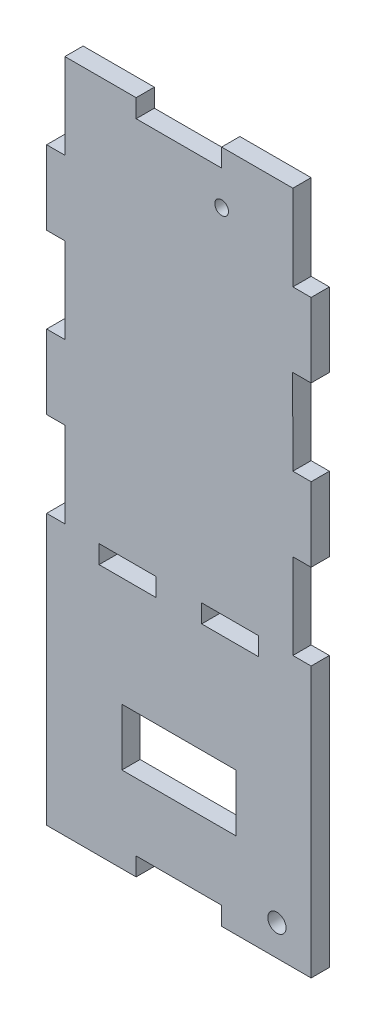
ISO-10303-21;
HEADER;
FILE_DESCRIPTION(('STEP AP214'),'2;1');
FILE_NAME('part.step','',(''),(''),'','','');
FILE_SCHEMA(('AUTOMOTIVE_DESIGN { 1 0 10303 214 1 1 1 1 }'));
ENDSEC;
DATA;
#1=APPLICATION_CONTEXT('core data for automotive mechanical design processes');
#2=APPLICATION_PROTOCOL_DEFINITION('international standard','automotive_design',2000,#1);
#3=PRODUCT_CONTEXT('',#1,'mechanical');
#4=PRODUCT('Part','Part','',(#3));
#5=PRODUCT_RELATED_PRODUCT_CATEGORY('part','',(#4));
#6=PRODUCT_DEFINITION_FORMATION('','',#4);
#7=PRODUCT_DEFINITION_CONTEXT('part definition',#1,'design');
#8=PRODUCT_DEFINITION('design','',#6,#7);
#9=PRODUCT_DEFINITION_SHAPE('','',#8);
#10=(LENGTH_UNIT() NAMED_UNIT(*) SI_UNIT(.MILLI.,.METRE.));
#11=(NAMED_UNIT(*) PLANE_ANGLE_UNIT() SI_UNIT($,.RADIAN.));
#12=(NAMED_UNIT(*) SI_UNIT($,.STERADIAN.) SOLID_ANGLE_UNIT());
#13=UNCERTAINTY_MEASURE_WITH_UNIT(LENGTH_MEASURE(1.E-05),#10,'distance_accuracy_value','');
#14=(GEOMETRIC_REPRESENTATION_CONTEXT(3) GLOBAL_UNCERTAINTY_ASSIGNED_CONTEXT((#13)) GLOBAL_UNIT_ASSIGNED_CONTEXT((#10,
#11,#12)) REPRESENTATION_CONTEXT('',''));
#15=CARTESIAN_POINT('',(0.,0.,0.));
#16=DIRECTION('',(0.,0.,1.));
#17=DIRECTION('',(1.,0.,0.));
#18=AXIS2_PLACEMENT_3D('',#15,#16,#17);
#19=CARTESIAN_POINT('',(0.,0.,16.));
#20=DIRECTION('',(0.,0.,-1.));
#21=DIRECTION('',(-1.,0.,0.));
#22=AXIS2_PLACEMENT_3D('',#19,#20,#21);
#23=PLANE('',#22);
#24=DIRECTION('',(0.,-1.,0.));
#25=VECTOR('',#24,1.);
#26=CARTESIAN_POINT('',(53.9999999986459,68.,16.));
#27=LINE('',#26,#25);
#28=CARTESIAN_POINT('',(53.9999999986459,68.,16.));
#29=VERTEX_POINT('',#28);
#30=CARTESIAN_POINT('',(53.9999999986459,18.,16.));
#31=VERTEX_POINT('',#30);
#32=EDGE_CURVE('E934',#29,#31,#27,.T.);
#33=ORIENTED_EDGE('',*,*,#32,.F.);
#34=DIRECTION('',(1.,0.,0.));
#35=VECTOR('',#34,1.);
#36=CARTESIAN_POINT('',(53.9999999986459,68.,16.));
#37=LINE('',#36,#35);
#38=CARTESIAN_POINT('',(153.999999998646,68.,16.));
#39=VERTEX_POINT('',#38);
#40=EDGE_CURVE('E931',#29,#39,#37,.T.);
#41=ORIENTED_EDGE('',*,*,#40,.T.);
#42=DIRECTION('',(0.,-1.,0.));
#43=VECTOR('',#42,1.);
#44=CARTESIAN_POINT('',(153.999999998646,68.,16.));
#45=LINE('',#44,#43);
#46=CARTESIAN_POINT('',(153.999999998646,18.,16.));
#47=VERTEX_POINT('',#46);
#48=EDGE_CURVE('E937',#39,#47,#45,.T.);
#49=ORIENTED_EDGE('',*,*,#48,.T.);
#50=DIRECTION('',(1.,0.,0.));
#51=VECTOR('',#50,1.);
#52=CARTESIAN_POINT('',(53.9999999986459,18.,16.));
#53=LINE('',#52,#51);
#54=EDGE_CURVE('E941',#31,#47,#53,.T.);
#55=ORIENTED_EDGE('',*,*,#54,.F.);
#56=EDGE_LOOP('',(#33,#41,#49,#55));
#57=FACE_BOUND('',#56,.T.);
#58=DIRECTION('',(0.,1.,0.));
#59=VECTOR('',#58,1.);
#60=CARTESIAN_POINT('',(-12.0000000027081,163.999999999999,16.));
#61=LINE('',#60,#59);
#62=CARTESIAN_POINT('',(-12.0000000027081,-57.,16.));
#63=VERTEX_POINT('',#62);
#64=CARTESIAN_POINT('',(-12.0000000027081,179.999999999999,16.));
#65=VERTEX_POINT('',#64);
#66=EDGE_CURVE('E1038',#63,#65,#61,.T.);
#67=ORIENTED_EDGE('',*,*,#66,.F.);
#68=DIRECTION('',(-1.,0.,0.));
#69=VECTOR('',#68,1.);
#70=CARTESIAN_POINT('',(66.499999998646,-56.9999999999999,16.));
#71=LINE('',#70,#69);
#72=CARTESIAN_POINT('',(66.499999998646,-56.9999999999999,16.));
#73=VERTEX_POINT('',#72);
#74=EDGE_CURVE('E1116',#73,#63,#71,.T.);
#75=ORIENTED_EDGE('',*,*,#74,.F.);
#76=DIRECTION('',(0.,1.,0.));
#77=VECTOR('',#76,1.);
#78=CARTESIAN_POINT('',(66.499999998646,-56.9999999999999,16.));
#79=LINE('',#78,#77);
#80=CARTESIAN_POINT('',(66.499999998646,-40.9999999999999,16.));
#81=VERTEX_POINT('',#80);
#82=EDGE_CURVE('E1114',#73,#81,#79,.T.);
#83=ORIENTED_EDGE('',*,*,#82,.T.);
#84=DIRECTION('',(1.,0.,0.));
#85=VECTOR('',#84,1.);
#86=CARTESIAN_POINT('',(66.499999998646,-40.9999999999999,16.));
#87=LINE('',#86,#85);
#88=CARTESIAN_POINT('',(141.499999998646,-40.9999999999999,16.));
#89=VERTEX_POINT('',#88);
#90=EDGE_CURVE('E1112',#81,#89,#87,.T.);
#91=ORIENTED_EDGE('',*,*,#90,.T.);
#92=DIRECTION('',(0.,1.,0.));
#93=VECTOR('',#92,1.);
#94=CARTESIAN_POINT('',(141.499999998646,-56.9999999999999,16.));
#95=LINE('',#94,#93);
#96=CARTESIAN_POINT('',(141.499999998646,-56.9999999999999,16.));
#97=VERTEX_POINT('',#96);
#98=EDGE_CURVE('E1109',#97,#89,#95,.T.);
#99=ORIENTED_EDGE('',*,*,#98,.F.);
#100=DIRECTION('',(-1.,0.,0.));
#101=VECTOR('',#100,1.);
#102=CARTESIAN_POINT('',(220.,-56.9999999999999,16.));
#103=LINE('',#102,#101);
#104=CARTESIAN_POINT('',(220.,-56.9999999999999,16.));
#105=VERTEX_POINT('',#104);
#106=EDGE_CURVE('E1106',#105,#97,#103,.T.);
#107=ORIENTED_EDGE('',*,*,#106,.F.);
#108=DIRECTION('',(0.,1.,0.));
#109=VECTOR('',#108,1.);
#110=CARTESIAN_POINT('',(220.,163.999999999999,16.));
#111=LINE('',#110,#109);
#112=CARTESIAN_POINT('',(220.,180.,16.));
#113=VERTEX_POINT('',#112);
#114=EDGE_CURVE('E1104',#105,#113,#111,.T.);
#115=ORIENTED_EDGE('',*,*,#114,.T.);
#116=DIRECTION('',(-1.,0.,0.));
#117=VECTOR('',#116,1.);
#118=CARTESIAN_POINT('',(220.,180.,16.));
#119=LINE('',#118,#117);
#120=CARTESIAN_POINT('',(204.,179.999999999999,16.));
#121=VERTEX_POINT('',#120);
#122=EDGE_CURVE('E1102',#113,#121,#119,.T.);
#123=ORIENTED_EDGE('',*,*,#122,.T.);
#124=DIRECTION('',(-3.61081535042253E-11,-1.,0.));
#125=VECTOR('',#124,1.);
#126=CARTESIAN_POINT('',(204.000000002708,255.,16.));
#127=LINE('',#126,#125);
#128=CARTESIAN_POINT('',(204.000000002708,255.,16.));
#129=VERTEX_POINT('',#128);
#130=EDGE_CURVE('E1099',#129,#121,#127,.T.);
#131=ORIENTED_EDGE('',*,*,#130,.F.);
#132=DIRECTION('',(-0.999999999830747,-1.83985496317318E-05,0.));
#133=VECTOR('',#132,1.);
#134=CARTESIAN_POINT('',(220.,255.000294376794,16.));
#135=LINE('',#134,#133);
#136=CARTESIAN_POINT('',(220.,255.000294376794,16.));
#137=VERTEX_POINT('',#136);
#138=EDGE_CURVE('E1096',#137,#129,#135,.T.);
#139=ORIENTED_EDGE('',*,*,#138,.F.);
#140=DIRECTION('',(0.,1.,0.));
#141=VECTOR('',#140,1.);
#142=CARTESIAN_POINT('',(220.,255.000294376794,16.));
#143=LINE('',#142,#141);
#144=CARTESIAN_POINT('',(220.,320.000294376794,16.));
#145=VERTEX_POINT('',#144);
#146=EDGE_CURVE('E1094',#137,#145,#143,.T.);
#147=ORIENTED_EDGE('',*,*,#146,.T.);
#148=DIRECTION('',(-1.,0.,0.));
#149=VECTOR('',#148,1.);
#150=CARTESIAN_POINT('',(220.,320.000294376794,16.));
#151=LINE('',#150,#149);
#152=CARTESIAN_POINT('',(204.,320.000294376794,16.));
#153=VERTEX_POINT('',#152);
#154=EDGE_CURVE('E1092',#145,#153,#151,.T.);
#155=ORIENTED_EDGE('',*,*,#154,.T.);
#156=DIRECTION('',(0.00280179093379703,-0.999996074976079,0.));
#157=VECTOR('',#156,1.);
#158=CARTESIAN_POINT('',(203.789865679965,395.,16.));
#159=LINE('',#158,#157);
#160=CARTESIAN_POINT('',(203.789865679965,395.,16.));
#161=VERTEX_POINT('',#160);
#162=EDGE_CURVE('E1089',#161,#153,#159,.T.);
#163=ORIENTED_EDGE('',*,*,#162,.F.);
#164=DIRECTION('',(-1.,0.,0.));
#165=VECTOR('',#164,1.);
#166=CARTESIAN_POINT('',(220.,395.,16.));
#167=LINE('',#166,#165);
#168=CARTESIAN_POINT('',(220.,395.,16.));
#169=VERTEX_POINT('',#168);
#170=EDGE_CURVE('E1086',#169,#161,#167,.T.);
#171=ORIENTED_EDGE('',*,*,#170,.F.);
#172=DIRECTION('',(0.,1.,0.));
#173=VECTOR('',#172,1.);
#174=CARTESIAN_POINT('',(220.,395.,16.));
#175=LINE('',#174,#173);
#176=CARTESIAN_POINT('',(220.,460.,16.));
#177=VERTEX_POINT('',#176);
#178=EDGE_CURVE('E1084',#169,#177,#175,.T.);
#179=ORIENTED_EDGE('',*,*,#178,.T.);
#180=DIRECTION('',(-1.,0.,0.));
#181=VECTOR('',#180,1.);
#182=CARTESIAN_POINT('',(220.,460.,16.));
#183=LINE('',#182,#181);
#184=CARTESIAN_POINT('',(204.,460.,16.));
#185=VERTEX_POINT('',#184);
#186=EDGE_CURVE('E1082',#177,#185,#183,.T.);
#187=ORIENTED_EDGE('',*,*,#186,.T.);
#188=DIRECTION('',(0.,-1.,0.));
#189=VECTOR('',#188,1.);
#190=CARTESIAN_POINT('',(204.,535.,16.));
#191=LINE('',#190,#189);
#192=CARTESIAN_POINT('',(204.,535.,16.));
#193=VERTEX_POINT('',#192);
#194=EDGE_CURVE('E1079',#193,#185,#191,.T.);
#195=ORIENTED_EDGE('',*,*,#194,.F.);
#196=DIRECTION('',(-1.,0.,0.));
#197=VECTOR('',#196,1.);
#198=CARTESIAN_POINT('',(204.,535.,16.));
#199=LINE('',#198,#197);
#200=CARTESIAN_POINT('',(141.5,535.,16.));
#201=VERTEX_POINT('',#200);
#202=EDGE_CURVE('E1077',#193,#201,#199,.T.);
#203=ORIENTED_EDGE('',*,*,#202,.T.);
#204=DIRECTION('',(0.,-1.,0.));
#205=VECTOR('',#204,1.);
#206=CARTESIAN_POINT('',(141.5,535.,16.));
#207=LINE('',#206,#205);
#208=CARTESIAN_POINT('',(141.5,519.,16.));
#209=VERTEX_POINT('',#208);
#210=EDGE_CURVE('E1075',#201,#209,#207,.T.);
#211=ORIENTED_EDGE('',*,*,#210,.T.);
#212=DIRECTION('',(1.,0.,0.));
#213=VECTOR('',#212,1.);
#214=CARTESIAN_POINT('',(66.4999999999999,519.,16.));
#215=LINE('',#214,#213);
#216=CARTESIAN_POINT('',(66.4999999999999,519.,16.));
#217=VERTEX_POINT('',#216);
#218=EDGE_CURVE('E1072',#217,#209,#215,.T.);
#219=ORIENTED_EDGE('',*,*,#218,.F.);
#220=DIRECTION('',(0.,-1.,0.));
#221=VECTOR('',#220,1.);
#222=CARTESIAN_POINT('',(66.4999999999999,535.,16.));
#223=LINE('',#222,#221);
#224=CARTESIAN_POINT('',(66.4999999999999,535.,16.));
#225=VERTEX_POINT('',#224);
#226=EDGE_CURVE('E1069',#225,#217,#223,.T.);
#227=ORIENTED_EDGE('',*,*,#226,.F.);
#228=DIRECTION('',(-1.,0.,0.));
#229=VECTOR('',#228,1.);
#230=CARTESIAN_POINT('',(66.4999999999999,535.,16.));
#231=LINE('',#230,#229);
#232=CARTESIAN_POINT('',(3.99999999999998,535.,16.));
#233=VERTEX_POINT('',#232);
#234=EDGE_CURVE('E1067',#225,#233,#231,.T.);
#235=ORIENTED_EDGE('',*,*,#234,.T.);
#236=DIRECTION('',(0.,-1.,0.));
#237=VECTOR('',#236,1.);
#238=CARTESIAN_POINT('',(3.99999999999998,535.,16.));
#239=LINE('',#238,#237);
#240=CARTESIAN_POINT('',(3.99999999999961,460.,16.));
#241=VERTEX_POINT('',#240);
#242=EDGE_CURVE('E1065',#233,#241,#239,.T.);
#243=ORIENTED_EDGE('',*,*,#242,.T.);
#244=DIRECTION('',(1.,0.,0.));
#245=VECTOR('',#244,1.);
#246=CARTESIAN_POINT('',(-12.,460.,16.));
#247=LINE('',#246,#245);
#248=CARTESIAN_POINT('',(-12.,460.,16.));
#249=VERTEX_POINT('',#248);
#250=EDGE_CURVE('E1062',#249,#241,#247,.T.);
#251=ORIENTED_EDGE('',*,*,#250,.F.);
#252=DIRECTION('',(0.,1.,0.));
#253=VECTOR('',#252,1.);
#254=CARTESIAN_POINT('',(-12.,395.,16.));
#255=LINE('',#254,#253);
#256=CARTESIAN_POINT('',(-12.,395.,16.));
#257=VERTEX_POINT('',#256);
#258=EDGE_CURVE('E1059',#257,#249,#255,.T.);
#259=ORIENTED_EDGE('',*,*,#258,.F.);
#260=DIRECTION('',(1.,0.,0.));
#261=VECTOR('',#260,1.);
#262=CARTESIAN_POINT('',(-12.,395.,16.));
#263=LINE('',#262,#261);
#264=CARTESIAN_POINT('',(4.21013432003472,395.,16.));
#265=VERTEX_POINT('',#264);
#266=EDGE_CURVE('E1057',#257,#265,#263,.T.);
#267=ORIENTED_EDGE('',*,*,#266,.T.);
#268=DIRECTION('',(-0.00280179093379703,-0.999996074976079,0.));
#269=VECTOR('',#268,1.);
#270=CARTESIAN_POINT('',(4.21013432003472,395.,16.));
#271=LINE('',#270,#269);
#272=CARTESIAN_POINT('',(3.99999999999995,320.000294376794,16.));
#273=VERTEX_POINT('',#272);
#274=EDGE_CURVE('E1055',#265,#273,#271,.T.);
#275=ORIENTED_EDGE('',*,*,#274,.T.);
#276=DIRECTION('',(1.,0.,0.));
#277=VECTOR('',#276,1.);
#278=CARTESIAN_POINT('',(-12.,320.000294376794,16.));
#279=LINE('',#278,#277);
#280=CARTESIAN_POINT('',(-12.,320.000294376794,16.));
#281=VERTEX_POINT('',#280);
#282=EDGE_CURVE('E1052',#281,#273,#279,.T.);
#283=ORIENTED_EDGE('',*,*,#282,.F.);
#284=DIRECTION('',(0.,1.,0.));
#285=VECTOR('',#284,1.);
#286=CARTESIAN_POINT('',(-12.0000000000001,255.000294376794,16.));
#287=LINE('',#286,#285);
#288=CARTESIAN_POINT('',(-12.0000000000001,255.000294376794,16.));
#289=VERTEX_POINT('',#288);
#290=EDGE_CURVE('E1049',#289,#281,#287,.T.);
#291=ORIENTED_EDGE('',*,*,#290,.F.);
#292=DIRECTION('',(0.999999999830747,-1.83985496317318E-05,0.));
#293=VECTOR('',#292,1.);
#294=CARTESIAN_POINT('',(-12.0000000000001,255.000294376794,16.));
#295=LINE('',#294,#293);
#296=CARTESIAN_POINT('',(3.99999999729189,255.,16.));
#297=VERTEX_POINT('',#296);
#298=EDGE_CURVE('E1047',#289,#297,#295,.T.);
#299=ORIENTED_EDGE('',*,*,#298,.T.);
#300=DIRECTION('',(0.,-1.,0.));
#301=VECTOR('',#300,1.);
#302=CARTESIAN_POINT('',(3.99999999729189,255.,16.));
#303=LINE('',#302,#301);
#304=CARTESIAN_POINT('',(3.99999999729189,179.999999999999,16.));
#305=VERTEX_POINT('',#304);
#306=EDGE_CURVE('E1045',#297,#305,#303,.T.);
#307=ORIENTED_EDGE('',*,*,#306,.T.);
#308=DIRECTION('',(1.,0.,0.));
#309=VECTOR('',#308,1.);
#310=CARTESIAN_POINT('',(-12.0000000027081,179.999999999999,16.));
#311=LINE('',#310,#309);
#312=EDGE_CURVE('E1041',#65,#305,#311,.T.);
#313=ORIENTED_EDGE('',*,*,#312,.F.);
#314=EDGE_LOOP('',(#67,#75,#83,#91,#99,#107,#115,#123,#131,#139,#147,#155,#163,#171,#179,#187,
#195,#203,#211,#219,#227,#235,#243,#251,#259,#267,#275,#283,#291,#299,#307,#313));
#315=FACE_BOUND('',#314,.T.);
#316=DIRECTION('',(1.,0.,0.));
#317=VECTOR('',#316,1.);
#318=CARTESIAN_POINT('',(0.,179.999999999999,16.));
#319=LINE('',#318,#317);
#320=CARTESIAN_POINT('',(33.9999999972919,179.999999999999,16.));
#321=VERTEX_POINT('',#320);
#322=CARTESIAN_POINT('',(83.9999999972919,179.999999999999,16.));
#323=VERTEX_POINT('',#322);
#324=EDGE_CURVE('E1010',#321,#323,#319,.T.);
#325=ORIENTED_EDGE('',*,*,#324,.T.);
#326=DIRECTION('',(0.,-1.,0.));
#327=VECTOR('',#326,1.);
#328=CARTESIAN_POINT('',(83.9999999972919,0.,16.));
#329=LINE('',#328,#327);
#330=CARTESIAN_POINT('',(83.9999999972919,163.999999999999,16.));
#331=VERTEX_POINT('',#330);
#332=EDGE_CURVE('E1007',#323,#331,#329,.T.);
#333=ORIENTED_EDGE('',*,*,#332,.T.);
#334=DIRECTION('',(1.,0.,0.));
#335=VECTOR('',#334,1.);
#336=CARTESIAN_POINT('',(0.,163.999999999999,16.));
#337=LINE('',#336,#335);
#338=CARTESIAN_POINT('',(33.9999999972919,163.999999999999,16.));
#339=VERTEX_POINT('',#338);
#340=EDGE_CURVE('E1017',#339,#331,#337,.T.);
#341=ORIENTED_EDGE('',*,*,#340,.F.);
#342=DIRECTION('',(0.,-1.,0.));
#343=VECTOR('',#342,1.);
#344=CARTESIAN_POINT('',(33.9999999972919,0.,16.));
#345=LINE('',#344,#343);
#346=EDGE_CURVE('E1014',#321,#339,#345,.T.);
#347=ORIENTED_EDGE('',*,*,#346,.F.);
#348=EDGE_LOOP('',(#325,#333,#341,#347));
#349=FACE_BOUND('',#348,.T.);
#350=DIRECTION('',(-1.,0.,0.));
#351=VECTOR('',#350,1.);
#352=CARTESIAN_POINT('',(0.,179.999999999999,16.));
#353=LINE('',#352,#351);
#354=CARTESIAN_POINT('',(174.,179.999999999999,16.));
#355=VERTEX_POINT('',#354);
#356=CARTESIAN_POINT('',(124.,179.999999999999,16.));
#357=VERTEX_POINT('',#356);
#358=EDGE_CURVE('E975',#355,#357,#353,.T.);
#359=ORIENTED_EDGE('',*,*,#358,.F.);
#360=DIRECTION('',(0.,-1.,0.));
#361=VECTOR('',#360,1.);
#362=CARTESIAN_POINT('',(174.,0.,16.));
#363=LINE('',#362,#361);
#364=CARTESIAN_POINT('',(174.,163.999999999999,16.));
#365=VERTEX_POINT('',#364);
#366=EDGE_CURVE('E983',#355,#365,#363,.T.);
#367=ORIENTED_EDGE('',*,*,#366,.T.);
#368=DIRECTION('',(-1.,0.,0.));
#369=VECTOR('',#368,1.);
#370=CARTESIAN_POINT('',(0.,163.999999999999,16.));
#371=LINE('',#370,#369);
#372=CARTESIAN_POINT('',(124.,163.999999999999,16.));
#373=VERTEX_POINT('',#372);
#374=EDGE_CURVE('E980',#365,#373,#371,.T.);
#375=ORIENTED_EDGE('',*,*,#374,.T.);
#376=DIRECTION('',(0.,-1.,0.));
#377=VECTOR('',#376,1.);
#378=CARTESIAN_POINT('',(124.,0.,16.));
#379=LINE('',#378,#377);
#380=EDGE_CURVE('E977',#357,#373,#379,.T.);
#381=ORIENTED_EDGE('',*,*,#380,.F.);
#382=EDGE_LOOP('',(#359,#367,#375,#381));
#383=FACE_BOUND('',#382,.T.);
#384=CARTESIAN_POINT('',(141.5,489.,16.));
#385=DIRECTION('',(0.,0.,1.));
#386=DIRECTION('',(1.,0.,0.));
#387=AXIS2_PLACEMENT_3D('',#384,#385,#386);
#388=CIRCLE('',#387,6.00000000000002);
#389=CARTESIAN_POINT('',(147.5,489.,16.));
#390=VERTEX_POINT('',#389);
#391=EDGE_CURVE('E969',#390,#390,#388,.T.);
#392=ORIENTED_EDGE('',*,*,#391,.F.);
#393=EDGE_LOOP('',(#392));
#394=FACE_BOUND('',#393,.T.);
#395=CARTESIAN_POINT('',(190.,-30.,16.));
#396=DIRECTION('',(0.,0.,1.));
#397=DIRECTION('',(1.,0.,0.));
#398=AXIS2_PLACEMENT_3D('',#395,#396,#397);
#399=CIRCLE('',#398,8.00000000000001);
#400=CARTESIAN_POINT('',(198.,-30.,16.));
#401=VERTEX_POINT('',#400);
#402=EDGE_CURVE('E963',#401,#401,#399,.T.);
#403=ORIENTED_EDGE('',*,*,#402,.F.);
#404=EDGE_LOOP('',(#403));
#405=FACE_BOUND('',#404,.T.);
#406=ADVANCED_FACE('F646',(#57,#315,#349,#383,#394,#405),#23,.F.);
#407=CARTESIAN_POINT('',(0.,0.,0.));
#408=DIRECTION('',(0.,0.,-1.));
#409=DIRECTION('',(-1.,0.,0.));
#410=AXIS2_PLACEMENT_3D('',#407,#408,#409);
#411=PLANE('',#410);
#412=DIRECTION('',(1.,0.,0.));
#413=VECTOR('',#412,1.);
#414=CARTESIAN_POINT('',(53.9999999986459,68.,0.));
#415=LINE('',#414,#413);
#416=CARTESIAN_POINT('',(53.9999999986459,68.,0.));
#417=VERTEX_POINT('',#416);
#418=CARTESIAN_POINT('',(153.999999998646,68.,0.));
#419=VERTEX_POINT('',#418);
#420=EDGE_CURVE('E671',#417,#419,#415,.T.);
#421=ORIENTED_EDGE('',*,*,#420,.F.);
#422=DIRECTION('',(0.,-1.,0.));
#423=VECTOR('',#422,1.);
#424=CARTESIAN_POINT('',(53.9999999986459,68.,0.));
#425=LINE('',#424,#423);
#426=CARTESIAN_POINT('',(53.9999999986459,18.,0.));
#427=VERTEX_POINT('',#426);
#428=EDGE_CURVE('E944',#417,#427,#425,.T.);
#429=ORIENTED_EDGE('',*,*,#428,.T.);
#430=DIRECTION('',(1.,0.,0.));
#431=VECTOR('',#430,1.);
#432=CARTESIAN_POINT('',(53.9999999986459,18.,0.));
#433=LINE('',#432,#431);
#434=CARTESIAN_POINT('',(153.999999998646,18.,0.));
#435=VERTEX_POINT('',#434);
#436=EDGE_CURVE('E947',#427,#435,#433,.T.);
#437=ORIENTED_EDGE('',*,*,#436,.T.);
#438=DIRECTION('',(0.,-1.,0.));
#439=VECTOR('',#438,1.);
#440=CARTESIAN_POINT('',(153.999999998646,68.,0.));
#441=LINE('',#440,#439);
#442=EDGE_CURVE('E953',#419,#435,#441,.T.);
#443=ORIENTED_EDGE('',*,*,#442,.F.);
#444=EDGE_LOOP('',(#421,#429,#437,#443));
#445=FACE_BOUND('',#444,.T.);
#446=CARTESIAN_POINT('',(141.5,489.,0.));
#447=DIRECTION('',(0.,0.,1.));
#448=DIRECTION('',(1.,0.,0.));
#449=AXIS2_PLACEMENT_3D('',#446,#447,#448);
#450=CIRCLE('',#449,6.00000000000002);
#451=CARTESIAN_POINT('',(147.5,489.,0.));
#452=VERTEX_POINT('',#451);
#453=EDGE_CURVE('E966',#452,#452,#450,.T.);
#454=ORIENTED_EDGE('',*,*,#453,.T.);
#455=EDGE_LOOP('',(#454));
#456=FACE_BOUND('',#455,.T.);
#457=DIRECTION('',(0.,-1.,0.));
#458=VECTOR('',#457,1.);
#459=CARTESIAN_POINT('',(83.9999999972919,0.,0.));
#460=LINE('',#459,#458);
#461=CARTESIAN_POINT('',(83.9999999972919,179.999999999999,0.));
#462=VERTEX_POINT('',#461);
#463=CARTESIAN_POINT('',(83.9999999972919,163.999999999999,0.));
#464=VERTEX_POINT('',#463);
#465=EDGE_CURVE('E1006',#462,#464,#460,.T.);
#466=ORIENTED_EDGE('',*,*,#465,.F.);
#467=DIRECTION('',(1.,0.,0.));
#468=VECTOR('',#467,1.);
#469=CARTESIAN_POINT('',(0.,179.999999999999,0.));
#470=LINE('',#469,#468);
#471=CARTESIAN_POINT('',(33.9999999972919,179.999999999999,0.));
#472=VERTEX_POINT('',#471);
#473=EDGE_CURVE('E1021',#472,#462,#470,.T.);
#474=ORIENTED_EDGE('',*,*,#473,.F.);
#475=DIRECTION('',(0.,-1.,0.));
#476=VECTOR('',#475,1.);
#477=CARTESIAN_POINT('',(33.9999999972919,0.,0.));
#478=LINE('',#477,#476);
#479=CARTESIAN_POINT('',(33.9999999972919,163.999999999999,0.));
#480=VERTEX_POINT('',#479);
#481=EDGE_CURVE('E1024',#472,#480,#478,.T.);
#482=ORIENTED_EDGE('',*,*,#481,.T.);
#483=DIRECTION('',(1.,0.,0.));
#484=VECTOR('',#483,1.);
#485=CARTESIAN_POINT('',(0.,163.999999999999,0.));
#486=LINE('',#485,#484);
#487=EDGE_CURVE('E1011',#480,#464,#486,.T.);
#488=ORIENTED_EDGE('',*,*,#487,.T.);
#489=EDGE_LOOP('',(#466,#474,#482,#488));
#490=FACE_BOUND('',#489,.T.);
#491=DIRECTION('',(0.,-1.,0.));
#492=VECTOR('',#491,1.);
#493=CARTESIAN_POINT('',(-12.0000000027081,163.999999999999,0.));
#494=LINE('',#493,#492);
#495=CARTESIAN_POINT('',(-12.0000000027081,179.999999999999,0.));
#496=VERTEX_POINT('',#495);
#497=CARTESIAN_POINT('',(-12.0000000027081,-57.,0.));
#498=VERTEX_POINT('',#497);
#499=EDGE_CURVE('E1042',#496,#498,#494,.T.);
#500=ORIENTED_EDGE('',*,*,#499,.F.);
#501=DIRECTION('',(1.,0.,0.));
#502=VECTOR('',#501,1.);
#503=CARTESIAN_POINT('',(-12.0000000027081,179.999999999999,0.));
#504=LINE('',#503,#502);
#505=CARTESIAN_POINT('',(3.99999999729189,179.999999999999,0.));
#506=VERTEX_POINT('',#505);
#507=EDGE_CURVE('E1037',#496,#506,#504,.T.);
#508=ORIENTED_EDGE('',*,*,#507,.T.);
#509=DIRECTION('',(0.,-1.,0.));
#510=VECTOR('',#509,1.);
#511=CARTESIAN_POINT('',(3.99999999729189,255.,0.));
#512=LINE('',#511,#510);
#513=CARTESIAN_POINT('',(3.99999999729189,255.,0.));
#514=VERTEX_POINT('',#513);
#515=EDGE_CURVE('E1121',#514,#506,#512,.T.);
#516=ORIENTED_EDGE('',*,*,#515,.F.);
#517=DIRECTION('',(0.999999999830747,-1.83985496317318E-05,0.));
#518=VECTOR('',#517,1.);
#519=CARTESIAN_POINT('',(-12.0000000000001,255.000294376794,0.));
#520=LINE('',#519,#518);
#521=CARTESIAN_POINT('',(-12.0000000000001,255.000294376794,0.));
#522=VERTEX_POINT('',#521);
#523=EDGE_CURVE('E1124',#522,#514,#520,.T.);
#524=ORIENTED_EDGE('',*,*,#523,.F.);
#525=DIRECTION('',(0.,1.,0.));
#526=VECTOR('',#525,1.);
#527=CARTESIAN_POINT('',(-12.0000000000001,255.000294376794,0.));
#528=LINE('',#527,#526);
#529=CARTESIAN_POINT('',(-12.,320.000294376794,0.));
#530=VERTEX_POINT('',#529);
#531=EDGE_CURVE('E1126',#522,#530,#528,.T.);
#532=ORIENTED_EDGE('',*,*,#531,.T.);
#533=DIRECTION('',(1.,0.,0.));
#534=VECTOR('',#533,1.);
#535=CARTESIAN_POINT('',(-12.,320.000294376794,0.));
#536=LINE('',#535,#534);
#537=CARTESIAN_POINT('',(3.99999999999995,320.000294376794,0.));
#538=VERTEX_POINT('',#537);
#539=EDGE_CURVE('E1129',#530,#538,#536,.T.);
#540=ORIENTED_EDGE('',*,*,#539,.T.);
#541=DIRECTION('',(-0.00280179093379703,-0.999996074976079,0.));
#542=VECTOR('',#541,1.);
#543=CARTESIAN_POINT('',(4.21013432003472,395.,0.));
#544=LINE('',#543,#542);
#545=CARTESIAN_POINT('',(4.21013432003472,395.,0.));
#546=VERTEX_POINT('',#545);
#547=EDGE_CURVE('E1132',#546,#538,#544,.T.);
#548=ORIENTED_EDGE('',*,*,#547,.F.);
#549=DIRECTION('',(1.,0.,0.));
#550=VECTOR('',#549,1.);
#551=CARTESIAN_POINT('',(-12.,395.,0.));
#552=LINE('',#551,#550);
#553=CARTESIAN_POINT('',(-12.,395.,0.));
#554=VERTEX_POINT('',#553);
#555=EDGE_CURVE('E1135',#554,#546,#552,.T.);
#556=ORIENTED_EDGE('',*,*,#555,.F.);
#557=DIRECTION('',(0.,1.,0.));
#558=VECTOR('',#557,1.);
#559=CARTESIAN_POINT('',(-12.,395.,0.));
#560=LINE('',#559,#558);
#561=CARTESIAN_POINT('',(-12.,460.,0.));
#562=VERTEX_POINT('',#561);
#563=EDGE_CURVE('E1137',#554,#562,#560,.T.);
#564=ORIENTED_EDGE('',*,*,#563,.T.);
#565=DIRECTION('',(1.,0.,0.));
#566=VECTOR('',#565,1.);
#567=CARTESIAN_POINT('',(-12.,460.,0.));
#568=LINE('',#567,#566);
#569=CARTESIAN_POINT('',(3.99999999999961,460.,0.));
#570=VERTEX_POINT('',#569);
#571=EDGE_CURVE('E1140',#562,#570,#568,.T.);
#572=ORIENTED_EDGE('',*,*,#571,.T.);
#573=DIRECTION('',(0.,-1.,0.));
#574=VECTOR('',#573,1.);
#575=CARTESIAN_POINT('',(3.99999999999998,535.,0.));
#576=LINE('',#575,#574);
#577=CARTESIAN_POINT('',(3.99999999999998,535.,0.));
#578=VERTEX_POINT('',#577);
#579=EDGE_CURVE('E1143',#578,#570,#576,.T.);
#580=ORIENTED_EDGE('',*,*,#579,.F.);
#581=DIRECTION('',(-1.,0.,0.));
#582=VECTOR('',#581,1.);
#583=CARTESIAN_POINT('',(66.4999999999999,535.,0.));
#584=LINE('',#583,#582);
#585=CARTESIAN_POINT('',(66.4999999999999,535.,0.));
#586=VERTEX_POINT('',#585);
#587=EDGE_CURVE('E1146',#586,#578,#584,.T.);
#588=ORIENTED_EDGE('',*,*,#587,.F.);
#589=DIRECTION('',(0.,-1.,0.));
#590=VECTOR('',#589,1.);
#591=CARTESIAN_POINT('',(66.4999999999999,535.,0.));
#592=LINE('',#591,#590);
#593=CARTESIAN_POINT('',(66.4999999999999,519.,0.));
#594=VERTEX_POINT('',#593);
#595=EDGE_CURVE('E1148',#586,#594,#592,.T.);
#596=ORIENTED_EDGE('',*,*,#595,.T.);
#597=DIRECTION('',(1.,0.,0.));
#598=VECTOR('',#597,1.);
#599=CARTESIAN_POINT('',(66.4999999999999,519.,0.));
#600=LINE('',#599,#598);
#601=CARTESIAN_POINT('',(141.5,519.,0.));
#602=VERTEX_POINT('',#601);
#603=EDGE_CURVE('E1151',#594,#602,#600,.T.);
#604=ORIENTED_EDGE('',*,*,#603,.T.);
#605=DIRECTION('',(0.,-1.,0.));
#606=VECTOR('',#605,1.);
#607=CARTESIAN_POINT('',(141.5,535.,0.));
#608=LINE('',#607,#606);
#609=CARTESIAN_POINT('',(141.5,535.,0.));
#610=VERTEX_POINT('',#609);
#611=EDGE_CURVE('E1154',#610,#602,#608,.T.);
#612=ORIENTED_EDGE('',*,*,#611,.F.);
#613=DIRECTION('',(-1.,0.,0.));
#614=VECTOR('',#613,1.);
#615=CARTESIAN_POINT('',(204.,535.,0.));
#616=LINE('',#615,#614);
#617=CARTESIAN_POINT('',(204.,535.,0.));
#618=VERTEX_POINT('',#617);
#619=EDGE_CURVE('E1157',#618,#610,#616,.T.);
#620=ORIENTED_EDGE('',*,*,#619,.F.);
#621=DIRECTION('',(0.,-1.,0.));
#622=VECTOR('',#621,1.);
#623=CARTESIAN_POINT('',(204.,535.,0.));
#624=LINE('',#623,#622);
#625=CARTESIAN_POINT('',(204.,460.,0.));
#626=VERTEX_POINT('',#625);
#627=EDGE_CURVE('E1159',#618,#626,#624,.T.);
#628=ORIENTED_EDGE('',*,*,#627,.T.);
#629=DIRECTION('',(-1.,0.,0.));
#630=VECTOR('',#629,1.);
#631=CARTESIAN_POINT('',(220.,460.,0.));
#632=LINE('',#631,#630);
#633=CARTESIAN_POINT('',(220.,460.,0.));
#634=VERTEX_POINT('',#633);
#635=EDGE_CURVE('E1162',#634,#626,#632,.T.);
#636=ORIENTED_EDGE('',*,*,#635,.F.);
#637=DIRECTION('',(0.,1.,0.));
#638=VECTOR('',#637,1.);
#639=CARTESIAN_POINT('',(220.,395.,0.));
#640=LINE('',#639,#638);
#641=CARTESIAN_POINT('',(220.,395.,0.));
#642=VERTEX_POINT('',#641);
#643=EDGE_CURVE('E1165',#642,#634,#640,.T.);
#644=ORIENTED_EDGE('',*,*,#643,.F.);
#645=DIRECTION('',(-1.,0.,0.));
#646=VECTOR('',#645,1.);
#647=CARTESIAN_POINT('',(220.,395.,0.));
#648=LINE('',#647,#646);
#649=CARTESIAN_POINT('',(203.789865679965,395.,0.));
#650=VERTEX_POINT('',#649);
#651=EDGE_CURVE('E1167',#642,#650,#648,.T.);
#652=ORIENTED_EDGE('',*,*,#651,.T.);
#653=DIRECTION('',(0.00280179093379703,-0.999996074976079,0.));
#654=VECTOR('',#653,1.);
#655=CARTESIAN_POINT('',(203.789865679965,395.,0.));
#656=LINE('',#655,#654);
#657=CARTESIAN_POINT('',(204.,320.000294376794,0.));
#658=VERTEX_POINT('',#657);
#659=EDGE_CURVE('E1170',#650,#658,#656,.T.);
#660=ORIENTED_EDGE('',*,*,#659,.T.);
#661=DIRECTION('',(-1.,0.,0.));
#662=VECTOR('',#661,1.);
#663=CARTESIAN_POINT('',(220.,320.000294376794,0.));
#664=LINE('',#663,#662);
#665=CARTESIAN_POINT('',(220.,320.000294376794,0.));
#666=VERTEX_POINT('',#665);
#667=EDGE_CURVE('E1173',#666,#658,#664,.T.);
#668=ORIENTED_EDGE('',*,*,#667,.F.);
#669=DIRECTION('',(0.,1.,0.));
#670=VECTOR('',#669,1.);
#671=CARTESIAN_POINT('',(220.,255.000294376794,0.));
#672=LINE('',#671,#670);
#673=CARTESIAN_POINT('',(220.,255.000294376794,0.));
#674=VERTEX_POINT('',#673);
#675=EDGE_CURVE('E1176',#674,#666,#672,.T.);
#676=ORIENTED_EDGE('',*,*,#675,.F.);
#677=DIRECTION('',(-0.999999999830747,-1.83985496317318E-05,0.));
#678=VECTOR('',#677,1.);
#679=CARTESIAN_POINT('',(220.,255.000294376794,0.));
#680=LINE('',#679,#678);
#681=CARTESIAN_POINT('',(204.000000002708,255.,0.));
#682=VERTEX_POINT('',#681);
#683=EDGE_CURVE('E1178',#674,#682,#680,.T.);
#684=ORIENTED_EDGE('',*,*,#683,.T.);
#685=DIRECTION('',(-3.61081535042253E-11,-1.,0.));
#686=VECTOR('',#685,1.);
#687=CARTESIAN_POINT('',(204.000000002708,255.,0.));
#688=LINE('',#687,#686);
#689=CARTESIAN_POINT('',(204.,179.999999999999,0.));
#690=VERTEX_POINT('',#689);
#691=EDGE_CURVE('E1181',#682,#690,#688,.T.);
#692=ORIENTED_EDGE('',*,*,#691,.T.);
#693=DIRECTION('',(-1.,0.,0.));
#694=VECTOR('',#693,1.);
#695=CARTESIAN_POINT('',(220.,180.,0.));
#696=LINE('',#695,#694);
#697=CARTESIAN_POINT('',(220.,180.,0.));
#698=VERTEX_POINT('',#697);
#699=EDGE_CURVE('E1184',#698,#690,#696,.T.);
#700=ORIENTED_EDGE('',*,*,#699,.F.);
#701=DIRECTION('',(0.,1.,0.));
#702=VECTOR('',#701,1.);
#703=CARTESIAN_POINT('',(220.,-56.9999999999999,0.));
#704=LINE('',#703,#702);
#705=CARTESIAN_POINT('',(220.,-56.9999999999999,0.));
#706=VERTEX_POINT('',#705);
#707=EDGE_CURVE('E1187',#706,#698,#704,.T.);
#708=ORIENTED_EDGE('',*,*,#707,.F.);
#709=DIRECTION('',(-1.,0.,0.));
#710=VECTOR('',#709,1.);
#711=CARTESIAN_POINT('',(220.,-56.9999999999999,0.));
#712=LINE('',#711,#710);
#713=CARTESIAN_POINT('',(141.499999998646,-56.9999999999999,0.));
#714=VERTEX_POINT('',#713);
#715=EDGE_CURVE('E1189',#706,#714,#712,.T.);
#716=ORIENTED_EDGE('',*,*,#715,.T.);
#717=DIRECTION('',(0.,1.,0.));
#718=VECTOR('',#717,1.);
#719=CARTESIAN_POINT('',(141.499999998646,-56.9999999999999,0.));
#720=LINE('',#719,#718);
#721=CARTESIAN_POINT('',(141.499999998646,-40.9999999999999,0.));
#722=VERTEX_POINT('',#721);
#723=EDGE_CURVE('E1192',#714,#722,#720,.T.);
#724=ORIENTED_EDGE('',*,*,#723,.T.);
#725=DIRECTION('',(1.,0.,0.));
#726=VECTOR('',#725,1.);
#727=CARTESIAN_POINT('',(66.499999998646,-40.9999999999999,0.));
#728=LINE('',#727,#726);
#729=CARTESIAN_POINT('',(66.499999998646,-40.9999999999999,0.));
#730=VERTEX_POINT('',#729);
#731=EDGE_CURVE('E1195',#730,#722,#728,.T.);
#732=ORIENTED_EDGE('',*,*,#731,.F.);
#733=DIRECTION('',(0.,1.,0.));
#734=VECTOR('',#733,1.);
#735=CARTESIAN_POINT('',(66.499999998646,-56.9999999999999,0.));
#736=LINE('',#735,#734);
#737=CARTESIAN_POINT('',(66.499999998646,-56.9999999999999,0.));
#738=VERTEX_POINT('',#737);
#739=EDGE_CURVE('E1198',#738,#730,#736,.T.);
#740=ORIENTED_EDGE('',*,*,#739,.F.);
#741=DIRECTION('',(-1.,0.,0.));
#742=VECTOR('',#741,1.);
#743=CARTESIAN_POINT('',(66.499999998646,-56.9999999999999,0.));
#744=LINE('',#743,#742);
#745=EDGE_CURVE('E1200',#738,#498,#744,.T.);
#746=ORIENTED_EDGE('',*,*,#745,.T.);
#747=EDGE_LOOP('',(#500,#508,#516,#524,#532,#540,#548,#556,#564,#572,#580,#588,#596,#604,#612,
#620,#628,#636,#644,#652,#660,#668,#676,#684,#692,#700,#708,#716,#724,#732,#740,#746));
#748=FACE_BOUND('',#747,.T.);
#749=DIRECTION('',(0.,-1.,0.));
#750=VECTOR('',#749,1.);
#751=CARTESIAN_POINT('',(174.,0.,0.));
#752=LINE('',#751,#750);
#753=CARTESIAN_POINT('',(174.,179.999999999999,0.));
#754=VERTEX_POINT('',#753);
#755=CARTESIAN_POINT('',(174.,163.999999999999,0.));
#756=VERTEX_POINT('',#755);
#757=EDGE_CURVE('E978',#754,#756,#752,.T.);
#758=ORIENTED_EDGE('',*,*,#757,.F.);
#759=DIRECTION('',(-1.,0.,0.));
#760=VECTOR('',#759,1.);
#761=CARTESIAN_POINT('',(0.,179.999999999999,0.));
#762=LINE('',#761,#760);
#763=CARTESIAN_POINT('',(124.,179.999999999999,0.));
#764=VERTEX_POINT('',#763);
#765=EDGE_CURVE('E972',#754,#764,#762,.T.);
#766=ORIENTED_EDGE('',*,*,#765,.T.);
#767=DIRECTION('',(0.,-1.,0.));
#768=VECTOR('',#767,1.);
#769=CARTESIAN_POINT('',(124.,0.,0.));
#770=LINE('',#769,#768);
#771=CARTESIAN_POINT('',(124.,163.999999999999,0.));
#772=VERTEX_POINT('',#771);
#773=EDGE_CURVE('E989',#764,#772,#770,.T.);
#774=ORIENTED_EDGE('',*,*,#773,.T.);
#775=DIRECTION('',(-1.,0.,0.));
#776=VECTOR('',#775,1.);
#777=CARTESIAN_POINT('',(0.,163.999999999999,0.));
#778=LINE('',#777,#776);
#779=EDGE_CURVE('E992',#756,#772,#778,.T.);
#780=ORIENTED_EDGE('',*,*,#779,.F.);
#781=EDGE_LOOP('',(#758,#766,#774,#780));
#782=FACE_BOUND('',#781,.T.);
#783=CARTESIAN_POINT('',(190.,-30.,0.));
#784=DIRECTION('',(0.,0.,1.));
#785=DIRECTION('',(1.,0.,0.));
#786=AXIS2_PLACEMENT_3D('',#783,#784,#785);
#787=CIRCLE('',#786,8.00000000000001);
#788=CARTESIAN_POINT('',(198.,-30.,0.));
#789=VERTEX_POINT('',#788);
#790=EDGE_CURVE('E959',#789,#789,#787,.T.);
#791=ORIENTED_EDGE('',*,*,#790,.T.);
#792=EDGE_LOOP('',(#791));
#793=FACE_BOUND('',#792,.T.);
#794=ADVANCED_FACE('F1279',(#445,#456,#490,#748,#782,#793),#411,.T.);
#795=CARTESIAN_POINT('',(-12.0000000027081,163.999999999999,16.));
#796=DIRECTION('',(1.,0.,0.));
#797=DIRECTION('',(0.,0.,-1.));
#798=AXIS2_PLACEMENT_3D('',#795,#796,#797);
#799=PLANE('',#798);
#800=ORIENTED_EDGE('',*,*,#499,.T.);
#801=DIRECTION('',(0.,0.,-1.));
#802=VECTOR('',#801,1.);
#803=CARTESIAN_POINT('',(-12.0000000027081,-57.,16.));
#804=LINE('',#803,#802);
#805=EDGE_CURVE('E12',#63,#498,#804,.T.);
#806=ORIENTED_EDGE('',*,*,#805,.F.);
#807=ORIENTED_EDGE('',*,*,#66,.T.);
#808=DIRECTION('',(0.,0.,-1.));
#809=VECTOR('',#808,1.);
#810=CARTESIAN_POINT('',(-12.0000000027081,179.999999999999,16.));
#811=LINE('',#810,#809);
#812=EDGE_CURVE('E650',#65,#496,#811,.T.);
#813=ORIENTED_EDGE('',*,*,#812,.T.);
#814=EDGE_LOOP('',(#800,#806,#807,#813));
#815=FACE_BOUND('',#814,.T.);
#816=ADVANCED_FACE('F1274',(#815),#799,.F.);
#817=CARTESIAN_POINT('',(66.499999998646,-56.9999999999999,16.));
#818=DIRECTION('',(0.,-1.,0.));
#819=DIRECTION('',(1.,0.,0.));
#820=AXIS2_PLACEMENT_3D('',#817,#818,#819);
#821=PLANE('',#820);
#822=ORIENTED_EDGE('',*,*,#745,.F.);
#823=DIRECTION('',(0.,0.,-1.));
#824=VECTOR('',#823,1.);
#825=CARTESIAN_POINT('',(66.499999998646,-56.9999999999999,16.));
#826=LINE('',#825,#824);
#827=EDGE_CURVE('E655',#73,#738,#826,.T.);
#828=ORIENTED_EDGE('',*,*,#827,.F.);
#829=ORIENTED_EDGE('',*,*,#74,.T.);
#830=ORIENTED_EDGE('',*,*,#805,.T.);
#831=EDGE_LOOP('',(#822,#828,#829,#830));
#832=FACE_BOUND('',#831,.T.);
#833=ADVANCED_FACE('F1286',(#832),#821,.T.);
#834=CARTESIAN_POINT('',(66.499999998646,-56.9999999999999,16.));
#835=DIRECTION('',(-1.,0.,0.));
#836=DIRECTION('',(0.,0.,1.));
#837=AXIS2_PLACEMENT_3D('',#834,#835,#836);
#838=PLANE('',#837);
#839=ORIENTED_EDGE('',*,*,#739,.T.);
#840=DIRECTION('',(0.,0.,-1.));
#841=VECTOR('',#840,1.);
#842=CARTESIAN_POINT('',(66.499999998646,-40.9999999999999,16.));
#843=LINE('',#842,#841);
#844=EDGE_CURVE('E1205',#81,#730,#843,.T.);
#845=ORIENTED_EDGE('',*,*,#844,.F.);
#846=ORIENTED_EDGE('',*,*,#82,.F.);
#847=ORIENTED_EDGE('',*,*,#827,.T.);
#848=EDGE_LOOP('',(#839,#845,#846,#847));
#849=FACE_BOUND('',#848,.T.);
#850=ADVANCED_FACE('F1415',(#849),#838,.F.);
#851=CARTESIAN_POINT('',(66.499999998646,-40.9999999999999,16.));
#852=DIRECTION('',(0.,1.,0.));
#853=DIRECTION('',(0.,0.,1.));
#854=AXIS2_PLACEMENT_3D('',#851,#852,#853);
#855=PLANE('',#854);
#856=ORIENTED_EDGE('',*,*,#731,.T.);
#857=DIRECTION('',(0.,0.,-1.));
#858=VECTOR('',#857,1.);
#859=CARTESIAN_POINT('',(141.499999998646,-40.9999999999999,16.));
#860=LINE('',#859,#858);
#861=EDGE_CURVE('E1208',#89,#722,#860,.T.);
#862=ORIENTED_EDGE('',*,*,#861,.F.);
#863=ORIENTED_EDGE('',*,*,#90,.F.);
#864=ORIENTED_EDGE('',*,*,#844,.T.);
#865=EDGE_LOOP('',(#856,#862,#863,#864));
#866=FACE_BOUND('',#865,.T.);
#867=ADVANCED_FACE('F1413',(#866),#855,.F.);
#868=CARTESIAN_POINT('',(141.499999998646,-56.9999999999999,16.));
#869=DIRECTION('',(-1.,0.,0.));
#870=DIRECTION('',(0.,0.,1.));
#871=AXIS2_PLACEMENT_3D('',#868,#869,#870);
#872=PLANE('',#871);
#873=ORIENTED_EDGE('',*,*,#723,.F.);
#874=DIRECTION('',(0.,0.,-1.));
#875=VECTOR('',#874,1.);
#876=CARTESIAN_POINT('',(141.499999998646,-56.9999999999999,16.));
#877=LINE('',#876,#875);
#878=EDGE_CURVE('E1210',#97,#714,#877,.T.);
#879=ORIENTED_EDGE('',*,*,#878,.F.);
#880=ORIENTED_EDGE('',*,*,#98,.T.);
#881=ORIENTED_EDGE('',*,*,#861,.T.);
#882=EDGE_LOOP('',(#873,#879,#880,#881));
#883=FACE_BOUND('',#882,.T.);
#884=ADVANCED_FACE('F1411',(#883),#872,.T.);
#885=CARTESIAN_POINT('',(220.,-56.9999999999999,16.));
#886=DIRECTION('',(0.,-1.,0.));
#887=DIRECTION('',(1.,0.,0.));
#888=AXIS2_PLACEMENT_3D('',#885,#886,#887);
#889=PLANE('',#888);
#890=ORIENTED_EDGE('',*,*,#715,.F.);
#891=DIRECTION('',(0.,0.,-1.));
#892=VECTOR('',#891,1.);
#893=CARTESIAN_POINT('',(220.,-56.9999999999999,16.));
#894=LINE('',#893,#892);
#895=EDGE_CURVE('E1212',#105,#706,#894,.T.);
#896=ORIENTED_EDGE('',*,*,#895,.F.);
#897=ORIENTED_EDGE('',*,*,#106,.T.);
#898=ORIENTED_EDGE('',*,*,#878,.T.);
#899=EDGE_LOOP('',(#890,#896,#897,#898));
#900=FACE_BOUND('',#899,.T.);
#901=ADVANCED_FACE('F1405',(#900),#889,.T.);
#902=CARTESIAN_POINT('',(220.,-56.9999999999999,16.));
#903=DIRECTION('',(-1.,0.,0.));
#904=DIRECTION('',(0.,-1.,0.));
#905=AXIS2_PLACEMENT_3D('',#902,#903,#904);
#906=PLANE('',#905);
#907=ORIENTED_EDGE('',*,*,#707,.T.);
#908=DIRECTION('',(0.,0.,-1.));
#909=VECTOR('',#908,1.);
#910=CARTESIAN_POINT('',(220.,180.,16.));
#911=LINE('',#910,#909);
#912=EDGE_CURVE('E1214',#113,#698,#911,.T.);
#913=ORIENTED_EDGE('',*,*,#912,.F.);
#914=ORIENTED_EDGE('',*,*,#114,.F.);
#915=ORIENTED_EDGE('',*,*,#895,.T.);
#916=EDGE_LOOP('',(#907,#913,#914,#915));
#917=FACE_BOUND('',#916,.T.);
#918=ADVANCED_FACE('F1401',(#917),#906,.F.);
#919=CARTESIAN_POINT('',(220.,180.,16.));
#920=DIRECTION('',(0.,-1.,0.));
#921=DIRECTION('',(1.,0.,0.));
#922=AXIS2_PLACEMENT_3D('',#919,#920,#921);
#923=PLANE('',#922);
#924=ORIENTED_EDGE('',*,*,#699,.T.);
#925=DIRECTION('',(0.,0.,-1.));
#926=VECTOR('',#925,1.);
#927=CARTESIAN_POINT('',(204.,179.999999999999,16.));
#928=LINE('',#927,#926);
#929=EDGE_CURVE('E1217',#121,#690,#928,.T.);
#930=ORIENTED_EDGE('',*,*,#929,.F.);
#931=ORIENTED_EDGE('',*,*,#122,.F.);
#932=ORIENTED_EDGE('',*,*,#912,.T.);
#933=EDGE_LOOP('',(#924,#930,#931,#932));
#934=FACE_BOUND('',#933,.T.);
#935=ADVANCED_FACE('F1397',(#934),#923,.F.);
#936=CARTESIAN_POINT('',(204.000000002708,255.,16.));
#937=DIRECTION('',(1.,-3.61081535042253E-11,0.));
#938=DIRECTION('',(3.61081535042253E-11,1.,0.));
#939=AXIS2_PLACEMENT_3D('',#936,#937,#938);
#940=PLANE('',#939);
#941=ORIENTED_EDGE('',*,*,#691,.F.);
#942=DIRECTION('',(0.,0.,-1.));
#943=VECTOR('',#942,1.);
#944=CARTESIAN_POINT('',(204.000000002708,255.,16.));
#945=LINE('',#944,#943);
#946=EDGE_CURVE('E1219',#129,#682,#945,.T.);
#947=ORIENTED_EDGE('',*,*,#946,.F.);
#948=ORIENTED_EDGE('',*,*,#130,.T.);
#949=ORIENTED_EDGE('',*,*,#929,.T.);
#950=EDGE_LOOP('',(#941,#947,#948,#949));
#951=FACE_BOUND('',#950,.T.);
#952=ADVANCED_FACE('F1391',(#951),#940,.T.);
#953=CARTESIAN_POINT('',(220.,255.000294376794,16.));
#954=DIRECTION('',(1.83985496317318E-05,-0.999999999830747,0.));
#955=DIRECTION('',(0.999999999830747,1.83985496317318E-05,0.));
#956=AXIS2_PLACEMENT_3D('',#953,#954,#955);
#957=PLANE('',#956);
#958=ORIENTED_EDGE('',*,*,#683,.F.);
#959=DIRECTION('',(0.,0.,-1.));
#960=VECTOR('',#959,1.);
#961=CARTESIAN_POINT('',(220.,255.000294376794,16.));
#962=LINE('',#961,#960);
#963=EDGE_CURVE('E1221',#137,#674,#962,.T.);
#964=ORIENTED_EDGE('',*,*,#963,.F.);
#965=ORIENTED_EDGE('',*,*,#138,.T.);
#966=ORIENTED_EDGE('',*,*,#946,.T.);
#967=EDGE_LOOP('',(#958,#964,#965,#966));
#968=FACE_BOUND('',#967,.T.);
#969=ADVANCED_FACE('F1387',(#968),#957,.T.);
#970=CARTESIAN_POINT('',(220.,255.000294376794,16.));
#971=DIRECTION('',(-1.,0.,0.));
#972=DIRECTION('',(0.,-1.,0.));
#973=AXIS2_PLACEMENT_3D('',#970,#971,#972);
#974=PLANE('',#973);
#975=ORIENTED_EDGE('',*,*,#675,.T.);
#976=DIRECTION('',(0.,0.,-1.));
#977=VECTOR('',#976,1.);
#978=CARTESIAN_POINT('',(220.,320.000294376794,16.));
#979=LINE('',#978,#977);
#980=EDGE_CURVE('E1223',#145,#666,#979,.T.);
#981=ORIENTED_EDGE('',*,*,#980,.F.);
#982=ORIENTED_EDGE('',*,*,#146,.F.);
#983=ORIENTED_EDGE('',*,*,#963,.T.);
#984=EDGE_LOOP('',(#975,#981,#982,#983));
#985=FACE_BOUND('',#984,.T.);
#986=ADVANCED_FACE('F1383',(#985),#974,.F.);
#987=CARTESIAN_POINT('',(220.,320.000294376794,16.));
#988=DIRECTION('',(0.,-1.,0.));
#989=DIRECTION('',(0.,0.,-1.));
#990=AXIS2_PLACEMENT_3D('',#987,#988,#989);
#991=PLANE('',#990);
#992=ORIENTED_EDGE('',*,*,#667,.T.);
#993=DIRECTION('',(0.,0.,-1.));
#994=VECTOR('',#993,1.);
#995=CARTESIAN_POINT('',(204.,320.000294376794,16.));
#996=LINE('',#995,#994);
#997=EDGE_CURVE('E1226',#153,#658,#996,.T.);
#998=ORIENTED_EDGE('',*,*,#997,.F.);
#999=ORIENTED_EDGE('',*,*,#154,.F.);
#1000=ORIENTED_EDGE('',*,*,#980,.T.);
#1001=EDGE_LOOP('',(#992,#998,#999,#1000));
#1002=FACE_BOUND('',#1001,.T.);
#1003=ADVANCED_FACE('F1379',(#1002),#991,.F.);
#1004=CARTESIAN_POINT('',(203.789865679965,395.,16.));
#1005=DIRECTION('',(0.999996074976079,0.00280179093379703,0.));
#1006=DIRECTION('',(-0.00280179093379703,0.999996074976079,0.));
#1007=AXIS2_PLACEMENT_3D('',#1004,#1005,#1006);
#1008=PLANE('',#1007);
#1009=ORIENTED_EDGE('',*,*,#659,.F.);
#1010=DIRECTION('',(0.,0.,-1.));
#1011=VECTOR('',#1010,1.);
#1012=CARTESIAN_POINT('',(203.789865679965,395.,16.));
#1013=LINE('',#1012,#1011);
#1014=EDGE_CURVE('E1228',#161,#650,#1013,.T.);
#1015=ORIENTED_EDGE('',*,*,#1014,.F.);
#1016=ORIENTED_EDGE('',*,*,#162,.T.);
#1017=ORIENTED_EDGE('',*,*,#997,.T.);
#1018=EDGE_LOOP('',(#1009,#1015,#1016,#1017));
#1019=FACE_BOUND('',#1018,.T.);
#1020=ADVANCED_FACE('F1374',(#1019),#1008,.T.);
#1021=CARTESIAN_POINT('',(220.,395.,16.));
#1022=DIRECTION('',(0.,-1.,0.));
#1023=DIRECTION('',(1.,0.,0.));
#1024=AXIS2_PLACEMENT_3D('',#1021,#1022,#1023);
#1025=PLANE('',#1024);
#1026=ORIENTED_EDGE('',*,*,#651,.F.);
#1027=DIRECTION('',(0.,0.,-1.));
#1028=VECTOR('',#1027,1.);
#1029=CARTESIAN_POINT('',(220.,395.,16.));
#1030=LINE('',#1029,#1028);
#1031=EDGE_CURVE('E1230',#169,#642,#1030,.T.);
#1032=ORIENTED_EDGE('',*,*,#1031,.F.);
#1033=ORIENTED_EDGE('',*,*,#170,.T.);
#1034=ORIENTED_EDGE('',*,*,#1014,.T.);
#1035=EDGE_LOOP('',(#1026,#1032,#1033,#1034));
#1036=FACE_BOUND('',#1035,.T.);
#1037=ADVANCED_FACE('F1369',(#1036),#1025,.T.);
#1038=CARTESIAN_POINT('',(220.,395.,16.));
#1039=DIRECTION('',(-1.,0.,0.));
#1040=DIRECTION('',(0.,0.,1.));
#1041=AXIS2_PLACEMENT_3D('',#1038,#1039,#1040);
#1042=PLANE('',#1041);
#1043=ORIENTED_EDGE('',*,*,#643,.T.);
#1044=DIRECTION('',(0.,0.,-1.));
#1045=VECTOR('',#1044,1.);
#1046=CARTESIAN_POINT('',(220.,460.,16.));
#1047=LINE('',#1046,#1045);
#1048=EDGE_CURVE('E1232',#177,#634,#1047,.T.);
#1049=ORIENTED_EDGE('',*,*,#1048,.F.);
#1050=ORIENTED_EDGE('',*,*,#178,.F.);
#1051=ORIENTED_EDGE('',*,*,#1031,.T.);
#1052=EDGE_LOOP('',(#1043,#1049,#1050,#1051));
#1053=FACE_BOUND('',#1052,.T.);
#1054=ADVANCED_FACE('F1366',(#1053),#1042,.F.);
#1055=CARTESIAN_POINT('',(220.,460.,16.));
#1056=DIRECTION('',(0.,-1.,0.));
#1057=DIRECTION('',(1.,0.,0.));
#1058=AXIS2_PLACEMENT_3D('',#1055,#1056,#1057);
#1059=PLANE('',#1058);
#1060=ORIENTED_EDGE('',*,*,#635,.T.);
#1061=DIRECTION('',(0.,0.,-1.));
#1062=VECTOR('',#1061,1.);
#1063=CARTESIAN_POINT('',(204.,460.,16.));
#1064=LINE('',#1063,#1062);
#1065=EDGE_CURVE('E1235',#185,#626,#1064,.T.);
#1066=ORIENTED_EDGE('',*,*,#1065,.F.);
#1067=ORIENTED_EDGE('',*,*,#186,.F.);
#1068=ORIENTED_EDGE('',*,*,#1048,.T.);
#1069=EDGE_LOOP('',(#1060,#1066,#1067,#1068));
#1070=FACE_BOUND('',#1069,.T.);
#1071=ADVANCED_FACE('F1361',(#1070),#1059,.F.);
#1072=CARTESIAN_POINT('',(204.,535.,16.));
#1073=DIRECTION('',(1.,0.,0.));
#1074=DIRECTION('',(0.,1.,0.));
#1075=AXIS2_PLACEMENT_3D('',#1072,#1073,#1074);
#1076=PLANE('',#1075);
#1077=ORIENTED_EDGE('',*,*,#627,.F.);
#1078=DIRECTION('',(0.,0.,-1.));
#1079=VECTOR('',#1078,1.);
#1080=CARTESIAN_POINT('',(204.,535.,16.));
#1081=LINE('',#1080,#1079);
#1082=EDGE_CURVE('E1237',#193,#618,#1081,.T.);
#1083=ORIENTED_EDGE('',*,*,#1082,.F.);
#1084=ORIENTED_EDGE('',*,*,#194,.T.);
#1085=ORIENTED_EDGE('',*,*,#1065,.T.);
#1086=EDGE_LOOP('',(#1077,#1083,#1084,#1085));
#1087=FACE_BOUND('',#1086,.T.);
#1088=ADVANCED_FACE('F1355',(#1087),#1076,.T.);
#1089=CARTESIAN_POINT('',(204.,535.,16.));
#1090=DIRECTION('',(0.,-1.,0.));
#1091=DIRECTION('',(0.,0.,-1.));
#1092=AXIS2_PLACEMENT_3D('',#1089,#1090,#1091);
#1093=PLANE('',#1092);
#1094=ORIENTED_EDGE('',*,*,#619,.T.);
#1095=DIRECTION('',(0.,0.,-1.));
#1096=VECTOR('',#1095,1.);
#1097=CARTESIAN_POINT('',(141.5,535.,16.));
#1098=LINE('',#1097,#1096);
#1099=EDGE_CURVE('E1239',#201,#610,#1098,.T.);
#1100=ORIENTED_EDGE('',*,*,#1099,.F.);
#1101=ORIENTED_EDGE('',*,*,#202,.F.);
#1102=ORIENTED_EDGE('',*,*,#1082,.T.);
#1103=EDGE_LOOP('',(#1094,#1100,#1101,#1102));
#1104=FACE_BOUND('',#1103,.T.);
#1105=ADVANCED_FACE('F1352',(#1104),#1093,.F.);
#1106=CARTESIAN_POINT('',(141.5,535.,16.));
#1107=DIRECTION('',(1.,0.,0.));
#1108=DIRECTION('',(0.,0.,-1.));
#1109=AXIS2_PLACEMENT_3D('',#1106,#1107,#1108);
#1110=PLANE('',#1109);
#1111=ORIENTED_EDGE('',*,*,#611,.T.);
#1112=DIRECTION('',(0.,0.,-1.));
#1113=VECTOR('',#1112,1.);
#1114=CARTESIAN_POINT('',(141.5,519.,16.));
#1115=LINE('',#1114,#1113);
#1116=EDGE_CURVE('E1242',#209,#602,#1115,.T.);
#1117=ORIENTED_EDGE('',*,*,#1116,.F.);
#1118=ORIENTED_EDGE('',*,*,#210,.F.);
#1119=ORIENTED_EDGE('',*,*,#1099,.T.);
#1120=EDGE_LOOP('',(#1111,#1117,#1118,#1119));
#1121=FACE_BOUND('',#1120,.T.);
#1122=ADVANCED_FACE('F1347',(#1121),#1110,.F.);
#1123=CARTESIAN_POINT('',(66.4999999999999,519.,16.));
#1124=DIRECTION('',(0.,1.,0.));
#1125=DIRECTION('',(0.,0.,1.));
#1126=AXIS2_PLACEMENT_3D('',#1123,#1124,#1125);
#1127=PLANE('',#1126);
#1128=ORIENTED_EDGE('',*,*,#603,.F.);
#1129=DIRECTION('',(0.,0.,-1.));
#1130=VECTOR('',#1129,1.);
#1131=CARTESIAN_POINT('',(66.4999999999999,519.,16.));
#1132=LINE('',#1131,#1130);
#1133=EDGE_CURVE('E1244',#217,#594,#1132,.T.);
#1134=ORIENTED_EDGE('',*,*,#1133,.F.);
#1135=ORIENTED_EDGE('',*,*,#218,.T.);
#1136=ORIENTED_EDGE('',*,*,#1116,.T.);
#1137=EDGE_LOOP('',(#1128,#1134,#1135,#1136));
#1138=FACE_BOUND('',#1137,.T.);
#1139=ADVANCED_FACE('F1341',(#1138),#1127,.T.);
#1140=CARTESIAN_POINT('',(66.4999999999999,535.,16.));
#1141=DIRECTION('',(1.,0.,0.));
#1142=DIRECTION('',(0.,0.,-1.));
#1143=AXIS2_PLACEMENT_3D('',#1140,#1141,#1142);
#1144=PLANE('',#1143);
#1145=ORIENTED_EDGE('',*,*,#595,.F.);
#1146=DIRECTION('',(0.,0.,-1.));
#1147=VECTOR('',#1146,1.);
#1148=CARTESIAN_POINT('',(66.4999999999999,535.,16.));
#1149=LINE('',#1148,#1147);
#1150=EDGE_CURVE('E1246',#225,#586,#1149,.T.);
#1151=ORIENTED_EDGE('',*,*,#1150,.F.);
#1152=ORIENTED_EDGE('',*,*,#226,.T.);
#1153=ORIENTED_EDGE('',*,*,#1133,.T.);
#1154=EDGE_LOOP('',(#1145,#1151,#1152,#1153));
#1155=FACE_BOUND('',#1154,.T.);
#1156=ADVANCED_FACE('F1337',(#1155),#1144,.T.);
#1157=CARTESIAN_POINT('',(66.4999999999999,535.,16.));
#1158=DIRECTION('',(0.,-1.,0.));
#1159=DIRECTION('',(0.,0.,-1.));
#1160=AXIS2_PLACEMENT_3D('',#1157,#1158,#1159);
#1161=PLANE('',#1160);
#1162=ORIENTED_EDGE('',*,*,#587,.T.);
#1163=DIRECTION('',(0.,0.,-1.));
#1164=VECTOR('',#1163,1.);
#1165=CARTESIAN_POINT('',(3.99999999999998,535.,16.));
#1166=LINE('',#1165,#1164);
#1167=EDGE_CURVE('E1248',#233,#578,#1166,.T.);
#1168=ORIENTED_EDGE('',*,*,#1167,.F.);
#1169=ORIENTED_EDGE('',*,*,#234,.F.);
#1170=ORIENTED_EDGE('',*,*,#1150,.T.);
#1171=EDGE_LOOP('',(#1162,#1168,#1169,#1170));
#1172=FACE_BOUND('',#1171,.T.);
#1173=ADVANCED_FACE('F1333',(#1172),#1161,.F.);
#1174=CARTESIAN_POINT('',(3.99999999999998,535.,16.));
#1175=DIRECTION('',(1.,0.,0.));
#1176=DIRECTION('',(0.,1.,0.));
#1177=AXIS2_PLACEMENT_3D('',#1174,#1175,#1176);
#1178=PLANE('',#1177);
#1179=ORIENTED_EDGE('',*,*,#579,.T.);
#1180=DIRECTION('',(0.,0.,-1.));
#1181=VECTOR('',#1180,1.);
#1182=CARTESIAN_POINT('',(3.99999999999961,460.,16.));
#1183=LINE('',#1182,#1181);
#1184=EDGE_CURVE('E1251',#241,#570,#1183,.T.);
#1185=ORIENTED_EDGE('',*,*,#1184,.F.);
#1186=ORIENTED_EDGE('',*,*,#242,.F.);
#1187=ORIENTED_EDGE('',*,*,#1167,.T.);
#1188=EDGE_LOOP('',(#1179,#1185,#1186,#1187));
#1189=FACE_BOUND('',#1188,.T.);
#1190=ADVANCED_FACE('F1329',(#1189),#1178,.F.);
#1191=CARTESIAN_POINT('',(-12.,460.,16.));
#1192=DIRECTION('',(0.,1.,0.));
#1193=DIRECTION('',(-1.,0.,0.));
#1194=AXIS2_PLACEMENT_3D('',#1191,#1192,#1193);
#1195=PLANE('',#1194);
#1196=ORIENTED_EDGE('',*,*,#571,.F.);
#1197=DIRECTION('',(0.,0.,-1.));
#1198=VECTOR('',#1197,1.);
#1199=CARTESIAN_POINT('',(-12.,460.,16.));
#1200=LINE('',#1199,#1198);
#1201=EDGE_CURVE('E1253',#249,#562,#1200,.T.);
#1202=ORIENTED_EDGE('',*,*,#1201,.F.);
#1203=ORIENTED_EDGE('',*,*,#250,.T.);
#1204=ORIENTED_EDGE('',*,*,#1184,.T.);
#1205=EDGE_LOOP('',(#1196,#1202,#1203,#1204));
#1206=FACE_BOUND('',#1205,.T.);
#1207=ADVANCED_FACE('F1324',(#1206),#1195,.T.);
#1208=CARTESIAN_POINT('',(-12.,395.,16.));
#1209=DIRECTION('',(-1.,0.,0.));
#1210=DIRECTION('',(0.,0.,1.));
#1211=AXIS2_PLACEMENT_3D('',#1208,#1209,#1210);
#1212=PLANE('',#1211);
#1213=ORIENTED_EDGE('',*,*,#563,.F.);
#1214=DIRECTION('',(0.,0.,-1.));
#1215=VECTOR('',#1214,1.);
#1216=CARTESIAN_POINT('',(-12.,395.,16.));
#1217=LINE('',#1216,#1215);
#1218=EDGE_CURVE('E1255',#257,#554,#1217,.T.);
#1219=ORIENTED_EDGE('',*,*,#1218,.F.);
#1220=ORIENTED_EDGE('',*,*,#258,.T.);
#1221=ORIENTED_EDGE('',*,*,#1201,.T.);
#1222=EDGE_LOOP('',(#1213,#1219,#1220,#1221));
#1223=FACE_BOUND('',#1222,.T.);
#1224=ADVANCED_FACE('F1319',(#1223),#1212,.T.);
#1225=CARTESIAN_POINT('',(-12.,395.,16.));
#1226=DIRECTION('',(0.,1.,0.));
#1227=DIRECTION('',(-1.,0.,0.));
#1228=AXIS2_PLACEMENT_3D('',#1225,#1226,#1227);
#1229=PLANE('',#1228);
#1230=ORIENTED_EDGE('',*,*,#555,.T.);
#1231=DIRECTION('',(0.,0.,-1.));
#1232=VECTOR('',#1231,1.);
#1233=CARTESIAN_POINT('',(4.21013432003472,395.,16.));
#1234=LINE('',#1233,#1232);
#1235=EDGE_CURVE('E1257',#265,#546,#1234,.T.);
#1236=ORIENTED_EDGE('',*,*,#1235,.F.);
#1237=ORIENTED_EDGE('',*,*,#266,.F.);
#1238=ORIENTED_EDGE('',*,*,#1218,.T.);
#1239=EDGE_LOOP('',(#1230,#1236,#1237,#1238));
#1240=FACE_BOUND('',#1239,.T.);
#1241=ADVANCED_FACE('F1316',(#1240),#1229,.F.);
#1242=CARTESIAN_POINT('',(4.21013432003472,395.,16.));
#1243=DIRECTION('',(0.999996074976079,-0.00280179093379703,0.));
#1244=DIRECTION('',(0.00280179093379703,0.999996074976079,0.));
#1245=AXIS2_PLACEMENT_3D('',#1242,#1243,#1244);
#1246=PLANE('',#1245);
#1247=ORIENTED_EDGE('',*,*,#547,.T.);
#1248=DIRECTION('',(0.,0.,-1.));
#1249=VECTOR('',#1248,1.);
#1250=CARTESIAN_POINT('',(3.99999999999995,320.000294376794,16.));
#1251=LINE('',#1250,#1249);
#1252=EDGE_CURVE('E1260',#273,#538,#1251,.T.);
#1253=ORIENTED_EDGE('',*,*,#1252,.F.);
#1254=ORIENTED_EDGE('',*,*,#274,.F.);
#1255=ORIENTED_EDGE('',*,*,#1235,.T.);
#1256=EDGE_LOOP('',(#1247,#1253,#1254,#1255));
#1257=FACE_BOUND('',#1256,.T.);
#1258=ADVANCED_FACE('F1311',(#1257),#1246,.F.);
#1259=CARTESIAN_POINT('',(-12.,320.000294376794,16.));
#1260=DIRECTION('',(0.,1.,0.));
#1261=DIRECTION('',(0.,0.,1.));
#1262=AXIS2_PLACEMENT_3D('',#1259,#1260,#1261);
#1263=PLANE('',#1262);
#1264=ORIENTED_EDGE('',*,*,#539,.F.);
#1265=DIRECTION('',(0.,0.,-1.));
#1266=VECTOR('',#1265,1.);
#1267=CARTESIAN_POINT('',(-12.,320.000294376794,16.));
#1268=LINE('',#1267,#1266);
#1269=EDGE_CURVE('E1262',#281,#530,#1268,.T.);
#1270=ORIENTED_EDGE('',*,*,#1269,.F.);
#1271=ORIENTED_EDGE('',*,*,#282,.T.);
#1272=ORIENTED_EDGE('',*,*,#1252,.T.);
#1273=EDGE_LOOP('',(#1264,#1270,#1271,#1272));
#1274=FACE_BOUND('',#1273,.T.);
#1275=ADVANCED_FACE('F1305',(#1274),#1263,.T.);
#1276=CARTESIAN_POINT('',(-12.0000000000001,255.000294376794,16.));
#1277=DIRECTION('',(-1.,0.,0.));
#1278=DIRECTION('',(0.,-1.,0.));
#1279=AXIS2_PLACEMENT_3D('',#1276,#1277,#1278);
#1280=PLANE('',#1279);
#1281=ORIENTED_EDGE('',*,*,#531,.F.);
#1282=DIRECTION('',(0.,0.,-1.));
#1283=VECTOR('',#1282,1.);
#1284=CARTESIAN_POINT('',(-12.0000000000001,255.000294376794,16.));
#1285=LINE('',#1284,#1283);
#1286=EDGE_CURVE('E1264',#289,#522,#1285,.T.);
#1287=ORIENTED_EDGE('',*,*,#1286,.F.);
#1288=ORIENTED_EDGE('',*,*,#290,.T.);
#1289=ORIENTED_EDGE('',*,*,#1269,.T.);
#1290=EDGE_LOOP('',(#1281,#1287,#1288,#1289));
#1291=FACE_BOUND('',#1290,.T.);
#1292=ADVANCED_FACE('F1301',(#1291),#1280,.T.);
#1293=CARTESIAN_POINT('',(-12.0000000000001,255.000294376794,16.));
#1294=DIRECTION('',(1.83985496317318E-05,0.999999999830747,0.));
#1295=DIRECTION('',(-0.999999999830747,1.83985496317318E-05,0.));
#1296=AXIS2_PLACEMENT_3D('',#1293,#1294,#1295);
#1297=PLANE('',#1296);
#1298=ORIENTED_EDGE('',*,*,#523,.T.);
#1299=DIRECTION('',(0.,0.,-1.));
#1300=VECTOR('',#1299,1.);
#1301=CARTESIAN_POINT('',(3.99999999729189,255.,16.));
#1302=LINE('',#1301,#1300);
#1303=EDGE_CURVE('E1266',#297,#514,#1302,.T.);
#1304=ORIENTED_EDGE('',*,*,#1303,.F.);
#1305=ORIENTED_EDGE('',*,*,#298,.F.);
#1306=ORIENTED_EDGE('',*,*,#1286,.T.);
#1307=EDGE_LOOP('',(#1298,#1304,#1305,#1306));
#1308=FACE_BOUND('',#1307,.T.);
#1309=ADVANCED_FACE('F1298',(#1308),#1297,.F.);
#1310=CARTESIAN_POINT('',(3.99999999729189,255.,16.));
#1311=DIRECTION('',(1.,0.,0.));
#1312=DIRECTION('',(0.,0.,-1.));
#1313=AXIS2_PLACEMENT_3D('',#1310,#1311,#1312);
#1314=PLANE('',#1313);
#1315=ORIENTED_EDGE('',*,*,#515,.T.);
#1316=DIRECTION('',(0.,0.,-1.));
#1317=VECTOR('',#1316,1.);
#1318=CARTESIAN_POINT('',(3.99999999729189,179.999999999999,16.));
#1319=LINE('',#1318,#1317);
#1320=EDGE_CURVE('E1268',#305,#506,#1319,.T.);
#1321=ORIENTED_EDGE('',*,*,#1320,.F.);
#1322=ORIENTED_EDGE('',*,*,#306,.F.);
#1323=ORIENTED_EDGE('',*,*,#1303,.T.);
#1324=EDGE_LOOP('',(#1315,#1321,#1322,#1323));
#1325=FACE_BOUND('',#1324,.T.);
#1326=ADVANCED_FACE('F1296',(#1325),#1314,.F.);
#1327=CARTESIAN_POINT('',(-12.0000000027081,179.999999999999,16.));
#1328=DIRECTION('',(0.,1.,0.));
#1329=DIRECTION('',(0.,0.,1.));
#1330=AXIS2_PLACEMENT_3D('',#1327,#1328,#1329);
#1331=PLANE('',#1330);
#1332=ORIENTED_EDGE('',*,*,#507,.F.);
#1333=ORIENTED_EDGE('',*,*,#812,.F.);
#1334=ORIENTED_EDGE('',*,*,#312,.T.);
#1335=ORIENTED_EDGE('',*,*,#1320,.T.);
#1336=EDGE_LOOP('',(#1332,#1333,#1334,#1335));
#1337=FACE_BOUND('',#1336,.T.);
#1338=ADVANCED_FACE('F648',(#1337),#1331,.T.);
#1339=CARTESIAN_POINT('',(83.9999999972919,0.,16.));
#1340=DIRECTION('',(1.,0.,0.));
#1341=DIRECTION('',(0.,0.,-1.));
#1342=AXIS2_PLACEMENT_3D('',#1339,#1340,#1341);
#1343=PLANE('',#1342);
#1344=ORIENTED_EDGE('',*,*,#465,.T.);
#1345=DIRECTION('',(0.,0.,-1.));
#1346=VECTOR('',#1345,1.);
#1347=CARTESIAN_POINT('',(83.9999999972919,163.999999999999,16.));
#1348=LINE('',#1347,#1346);
#1349=EDGE_CURVE('E1019',#331,#464,#1348,.T.);
#1350=ORIENTED_EDGE('',*,*,#1349,.F.);
#1351=ORIENTED_EDGE('',*,*,#332,.F.);
#1352=DIRECTION('',(0.,0.,-1.));
#1353=VECTOR('',#1352,1.);
#1354=CARTESIAN_POINT('',(83.9999999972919,179.999999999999,16.));
#1355=LINE('',#1354,#1353);
#1356=EDGE_CURVE('E1035',#323,#462,#1355,.T.);
#1357=ORIENTED_EDGE('',*,*,#1356,.T.);
#1358=EDGE_LOOP('',(#1344,#1350,#1351,#1357));
#1359=FACE_BOUND('',#1358,.T.);
#1360=ADVANCED_FACE('F1432',(#1359),#1343,.F.);
#1361=CARTESIAN_POINT('',(0.,179.999999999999,16.));
#1362=DIRECTION('',(0.,1.,0.));
#1363=DIRECTION('',(0.,0.,1.));
#1364=AXIS2_PLACEMENT_3D('',#1361,#1362,#1363);
#1365=PLANE('',#1364);
#1366=ORIENTED_EDGE('',*,*,#473,.T.);
#1367=ORIENTED_EDGE('',*,*,#1356,.F.);
#1368=ORIENTED_EDGE('',*,*,#324,.F.);
#1369=DIRECTION('',(0.,0.,-1.));
#1370=VECTOR('',#1369,1.);
#1371=CARTESIAN_POINT('',(33.9999999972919,179.999999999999,16.));
#1372=LINE('',#1371,#1370);
#1373=EDGE_CURVE('E1033',#321,#472,#1372,.T.);
#1374=ORIENTED_EDGE('',*,*,#1373,.T.);
#1375=EDGE_LOOP('',(#1366,#1367,#1368,#1374));
#1376=FACE_BOUND('',#1375,.T.);
#1377=ADVANCED_FACE('F1687',(#1376),#1365,.F.);
#1378=CARTESIAN_POINT('',(33.9999999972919,0.,16.));
#1379=DIRECTION('',(1.,0.,0.));
#1380=DIRECTION('',(0.,0.,-1.));
#1381=AXIS2_PLACEMENT_3D('',#1378,#1379,#1380);
#1382=PLANE('',#1381);
#1383=ORIENTED_EDGE('',*,*,#481,.F.);
#1384=ORIENTED_EDGE('',*,*,#1373,.F.);
#1385=ORIENTED_EDGE('',*,*,#346,.T.);
#1386=DIRECTION('',(0.,0.,-1.));
#1387=VECTOR('',#1386,1.);
#1388=CARTESIAN_POINT('',(33.9999999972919,163.999999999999,16.));
#1389=LINE('',#1388,#1387);
#1390=EDGE_CURVE('E1031',#339,#480,#1389,.T.);
#1391=ORIENTED_EDGE('',*,*,#1390,.T.);
#1392=EDGE_LOOP('',(#1383,#1384,#1385,#1391));
#1393=FACE_BOUND('',#1392,.T.);
#1394=ADVANCED_FACE('F1696',(#1393),#1382,.T.);
#1395=CARTESIAN_POINT('',(0.,163.999999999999,16.));
#1396=DIRECTION('',(0.,1.,0.));
#1397=DIRECTION('',(0.,0.,1.));
#1398=AXIS2_PLACEMENT_3D('',#1395,#1396,#1397);
#1399=PLANE('',#1398);
#1400=ORIENTED_EDGE('',*,*,#487,.F.);
#1401=ORIENTED_EDGE('',*,*,#1390,.F.);
#1402=ORIENTED_EDGE('',*,*,#340,.T.);
#1403=ORIENTED_EDGE('',*,*,#1349,.T.);
#1404=EDGE_LOOP('',(#1400,#1401,#1402,#1403));
#1405=FACE_BOUND('',#1404,.T.);
#1406=ADVANCED_FACE('F1705',(#1405),#1399,.T.);
#1407=CARTESIAN_POINT('',(0.,179.999999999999,16.));
#1408=DIRECTION('',(0.,-1.,0.));
#1409=DIRECTION('',(0.,0.,-1.));
#1410=AXIS2_PLACEMENT_3D('',#1407,#1408,#1409);
#1411=PLANE('',#1410);
#1412=ORIENTED_EDGE('',*,*,#765,.F.);
#1413=DIRECTION('',(0.,0.,-1.));
#1414=VECTOR('',#1413,1.);
#1415=CARTESIAN_POINT('',(174.,179.999999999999,16.));
#1416=LINE('',#1415,#1414);
#1417=EDGE_CURVE('E986',#355,#754,#1416,.T.);
#1418=ORIENTED_EDGE('',*,*,#1417,.F.);
#1419=ORIENTED_EDGE('',*,*,#358,.T.);
#1420=DIRECTION('',(0.,0.,-1.));
#1421=VECTOR('',#1420,1.);
#1422=CARTESIAN_POINT('',(124.,179.999999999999,16.));
#1423=LINE('',#1422,#1421);
#1424=EDGE_CURVE('E1003',#357,#764,#1423,.T.);
#1425=ORIENTED_EDGE('',*,*,#1424,.T.);
#1426=EDGE_LOOP('',(#1412,#1418,#1419,#1425));
#1427=FACE_BOUND('',#1426,.T.);
#1428=ADVANCED_FACE('F1715',(#1427),#1411,.T.);
#1429=CARTESIAN_POINT('',(124.,0.,16.));
#1430=DIRECTION('',(1.,0.,0.));
#1431=DIRECTION('',(0.,0.,-1.));
#1432=AXIS2_PLACEMENT_3D('',#1429,#1430,#1431);
#1433=PLANE('',#1432);
#1434=ORIENTED_EDGE('',*,*,#773,.F.);
#1435=ORIENTED_EDGE('',*,*,#1424,.F.);
#1436=ORIENTED_EDGE('',*,*,#380,.T.);
#1437=DIRECTION('',(0.,0.,-1.));
#1438=VECTOR('',#1437,1.);
#1439=CARTESIAN_POINT('',(124.,163.999999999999,16.));
#1440=LINE('',#1439,#1438);
#1441=EDGE_CURVE('E1001',#373,#772,#1440,.T.);
#1442=ORIENTED_EDGE('',*,*,#1441,.T.);
#1443=EDGE_LOOP('',(#1434,#1435,#1436,#1442));
#1444=FACE_BOUND('',#1443,.T.);
#1445=ADVANCED_FACE('F1725',(#1444),#1433,.T.);
#1446=CARTESIAN_POINT('',(0.,163.999999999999,16.));
#1447=DIRECTION('',(0.,-1.,0.));
#1448=DIRECTION('',(0.,0.,-1.));
#1449=AXIS2_PLACEMENT_3D('',#1446,#1447,#1448);
#1450=PLANE('',#1449);
#1451=ORIENTED_EDGE('',*,*,#779,.T.);
#1452=ORIENTED_EDGE('',*,*,#1441,.F.);
#1453=ORIENTED_EDGE('',*,*,#374,.F.);
#1454=DIRECTION('',(0.,0.,-1.));
#1455=VECTOR('',#1454,1.);
#1456=CARTESIAN_POINT('',(174.,163.999999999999,16.));
#1457=LINE('',#1456,#1455);
#1458=EDGE_CURVE('E999',#365,#756,#1457,.T.);
#1459=ORIENTED_EDGE('',*,*,#1458,.T.);
#1460=EDGE_LOOP('',(#1451,#1452,#1453,#1459));
#1461=FACE_BOUND('',#1460,.T.);
#1462=ADVANCED_FACE('F1735',(#1461),#1450,.F.);
#1463=CARTESIAN_POINT('',(174.,0.,16.));
#1464=DIRECTION('',(1.,0.,0.));
#1465=DIRECTION('',(0.,0.,-1.));
#1466=AXIS2_PLACEMENT_3D('',#1463,#1464,#1465);
#1467=PLANE('',#1466);
#1468=ORIENTED_EDGE('',*,*,#757,.T.);
#1469=ORIENTED_EDGE('',*,*,#1458,.F.);
#1470=ORIENTED_EDGE('',*,*,#366,.F.);
#1471=ORIENTED_EDGE('',*,*,#1417,.T.);
#1472=EDGE_LOOP('',(#1468,#1469,#1470,#1471));
#1473=FACE_BOUND('',#1472,.T.);
#1474=ADVANCED_FACE('F1745',(#1473),#1467,.F.);
#1475=CARTESIAN_POINT('',(141.5,489.,16.));
#1476=DIRECTION('',(0.,0.,-1.));
#1477=DIRECTION('',(-1.,0.,0.));
#1478=AXIS2_PLACEMENT_3D('',#1475,#1476,#1477);
#1479=CYLINDRICAL_SURFACE('',#1478,6.00000000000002);
#1480=ORIENTED_EDGE('',*,*,#391,.T.);
#1481=EDGE_LOOP('',(#1480));
#1482=FACE_BOUND('',#1481,.T.);
#1483=ORIENTED_EDGE('',*,*,#453,.F.);
#1484=EDGE_LOOP('',(#1483));
#1485=FACE_BOUND('',#1484,.T.);
#1486=ADVANCED_FACE('F1755',(#1482,#1485),#1479,.F.);
#1487=CARTESIAN_POINT('',(190.,-30.,16.));
#1488=DIRECTION('',(0.,0.,-1.));
#1489=DIRECTION('',(-1.,0.,0.));
#1490=AXIS2_PLACEMENT_3D('',#1487,#1488,#1489);
#1491=CYLINDRICAL_SURFACE('',#1490,8.00000000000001);
#1492=ORIENTED_EDGE('',*,*,#402,.T.);
#1493=EDGE_LOOP('',(#1492));
#1494=FACE_BOUND('',#1493,.T.);
#1495=ORIENTED_EDGE('',*,*,#790,.F.);
#1496=EDGE_LOOP('',(#1495));
#1497=FACE_BOUND('',#1496,.T.);
#1498=ADVANCED_FACE('F1765',(#1494,#1497),#1491,.F.);
#1499=CARTESIAN_POINT('',(53.9999999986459,68.,16.));
#1500=DIRECTION('',(0.,1.,0.));
#1501=DIRECTION('',(0.,0.,1.));
#1502=AXIS2_PLACEMENT_3D('',#1499,#1500,#1501);
#1503=PLANE('',#1502);
#1504=ORIENTED_EDGE('',*,*,#420,.T.);
#1505=DIRECTION('',(0.,0.,-1.));
#1506=VECTOR('',#1505,1.);
#1507=CARTESIAN_POINT('',(153.999999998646,68.,16.));
#1508=LINE('',#1507,#1506);
#1509=EDGE_CURVE('E928',#39,#419,#1508,.T.);
#1510=ORIENTED_EDGE('',*,*,#1509,.F.);
#1511=ORIENTED_EDGE('',*,*,#40,.F.);
#1512=DIRECTION('',(0.,0.,-1.));
#1513=VECTOR('',#1512,1.);
#1514=CARTESIAN_POINT('',(53.9999999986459,68.,16.));
#1515=LINE('',#1514,#1513);
#1516=EDGE_CURVE('E957',#29,#417,#1515,.T.);
#1517=ORIENTED_EDGE('',*,*,#1516,.T.);
#1518=EDGE_LOOP('',(#1504,#1510,#1511,#1517));
#1519=FACE_BOUND('',#1518,.T.);
#1520=ADVANCED_FACE('F929',(#1519),#1503,.F.);
#1521=CARTESIAN_POINT('',(53.9999999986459,68.,16.));
#1522=DIRECTION('',(1.,0.,0.));
#1523=DIRECTION('',(0.,0.,-1.));
#1524=AXIS2_PLACEMENT_3D('',#1521,#1522,#1523);
#1525=PLANE('',#1524);
#1526=ORIENTED_EDGE('',*,*,#428,.F.);
#1527=ORIENTED_EDGE('',*,*,#1516,.F.);
#1528=ORIENTED_EDGE('',*,*,#32,.T.);
#1529=DIRECTION('',(0.,0.,-1.));
#1530=VECTOR('',#1529,1.);
#1531=CARTESIAN_POINT('',(53.9999999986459,18.,16.));
#1532=LINE('',#1531,#1530);
#1533=EDGE_CURVE('E960',#31,#427,#1532,.T.);
#1534=ORIENTED_EDGE('',*,*,#1533,.T.);
#1535=EDGE_LOOP('',(#1526,#1527,#1528,#1534));
#1536=FACE_BOUND('',#1535,.T.);
#1537=ADVANCED_FACE('F1784',(#1536),#1525,.T.);
#1538=CARTESIAN_POINT('',(53.9999999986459,18.,16.));
#1539=DIRECTION('',(0.,1.,0.));
#1540=DIRECTION('',(0.,0.,1.));
#1541=AXIS2_PLACEMENT_3D('',#1538,#1539,#1540);
#1542=PLANE('',#1541);
#1543=ORIENTED_EDGE('',*,*,#436,.F.);
#1544=ORIENTED_EDGE('',*,*,#1533,.F.);
#1545=ORIENTED_EDGE('',*,*,#54,.T.);
#1546=DIRECTION('',(0.,0.,-1.));
#1547=VECTOR('',#1546,1.);
#1548=CARTESIAN_POINT('',(153.999999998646,18.,16.));
#1549=LINE('',#1548,#1547);
#1550=EDGE_CURVE('E663',#47,#435,#1549,.T.);
#1551=ORIENTED_EDGE('',*,*,#1550,.T.);
#1552=EDGE_LOOP('',(#1543,#1544,#1545,#1551));
#1553=FACE_BOUND('',#1552,.T.);
#1554=ADVANCED_FACE('F1793',(#1553),#1542,.T.);
#1555=CARTESIAN_POINT('',(153.999999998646,68.,16.));
#1556=DIRECTION('',(1.,0.,0.));
#1557=DIRECTION('',(0.,0.,-1.));
#1558=AXIS2_PLACEMENT_3D('',#1555,#1556,#1557);
#1559=PLANE('',#1558);
#1560=ORIENTED_EDGE('',*,*,#442,.T.);
#1561=ORIENTED_EDGE('',*,*,#1550,.F.);
#1562=ORIENTED_EDGE('',*,*,#48,.F.);
#1563=ORIENTED_EDGE('',*,*,#1509,.T.);
#1564=EDGE_LOOP('',(#1560,#1561,#1562,#1563));
#1565=FACE_BOUND('',#1564,.T.);
#1566=ADVANCED_FACE('F938',(#1565),#1559,.F.);
#1567=CLOSED_SHELL('',(#406,#794,#816,#833,#850,#867,#884,#901,#918,#935,#952,#969,#986,#1003,
#1020,#1037,#1054,#1071,#1088,#1105,#1122,#1139,#1156,#1173,#1190,#1207,#1224,#1241,#1258,#1275,
#1292,#1309,#1326,#1338,#1360,#1377,#1394,#1406,#1428,#1445,#1462,#1474,#1486,#1498,#1520,#1537,
#1554,#1566));
#1568=MANIFOLD_SOLID_BREP('B2',#1567);
#1569=ADVANCED_BREP_SHAPE_REPRESENTATION('',(#18,#1568),#14);
#1570=SHAPE_DEFINITION_REPRESENTATION(#9,#1569);
ENDSEC;
END-ISO-10303-21;
